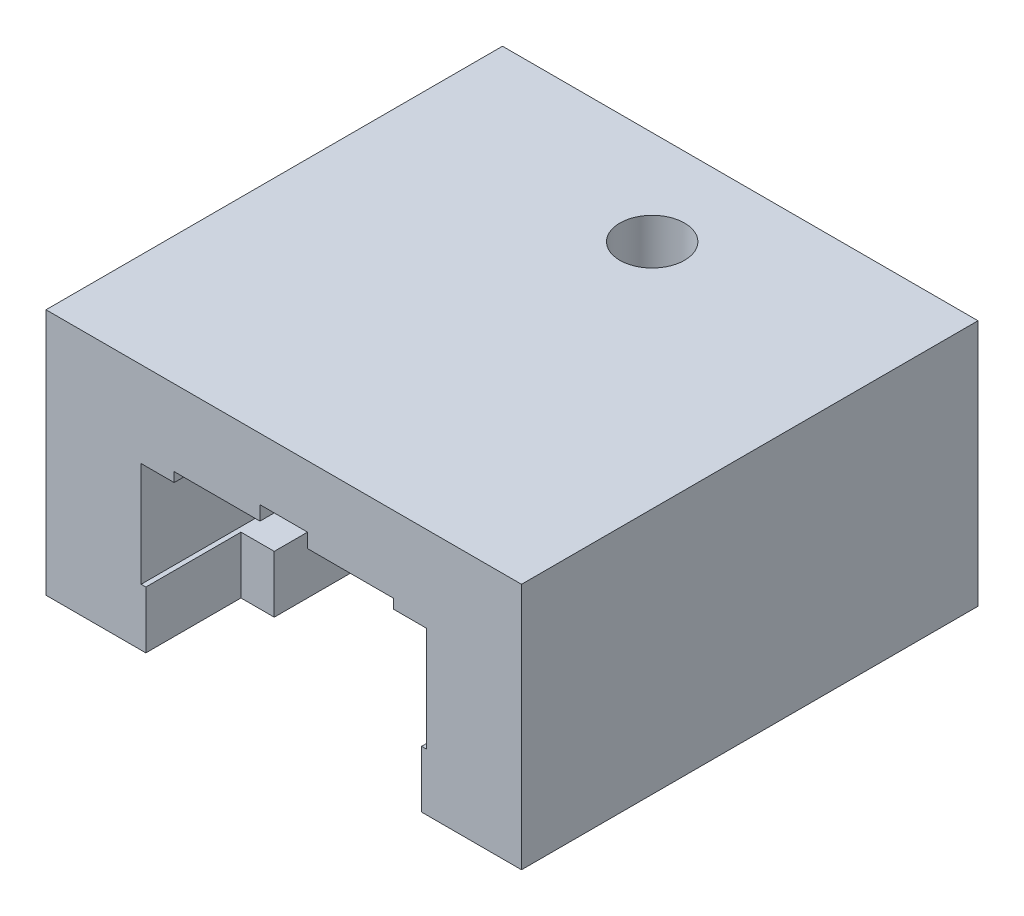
ISO-10303-21;
HEADER;
FILE_DESCRIPTION(('STEP AP214'),'2;1');
FILE_NAME('part.step','',(''),(''),'','','');
FILE_SCHEMA(('AUTOMOTIVE_DESIGN { 1 0 10303 214 1 1 1 1 }'));
ENDSEC;
DATA;
#1=APPLICATION_CONTEXT('core data for automotive mechanical design processes');
#2=APPLICATION_PROTOCOL_DEFINITION('international standard','automotive_design',2000,#1);
#3=PRODUCT_CONTEXT('',#1,'mechanical');
#4=PRODUCT('Part','Part','',(#3));
#5=PRODUCT_RELATED_PRODUCT_CATEGORY('part','',(#4));
#6=PRODUCT_DEFINITION_FORMATION('','',#4);
#7=PRODUCT_DEFINITION_CONTEXT('part definition',#1,'design');
#8=PRODUCT_DEFINITION('design','',#6,#7);
#9=PRODUCT_DEFINITION_SHAPE('','',#8);
#10=(LENGTH_UNIT() NAMED_UNIT(*) SI_UNIT(.MILLI.,.METRE.));
#11=(NAMED_UNIT(*) PLANE_ANGLE_UNIT() SI_UNIT($,.RADIAN.));
#12=(NAMED_UNIT(*) SI_UNIT($,.STERADIAN.) SOLID_ANGLE_UNIT());
#13=UNCERTAINTY_MEASURE_WITH_UNIT(LENGTH_MEASURE(1.E-05),#10,'distance_accuracy_value','');
#14=(GEOMETRIC_REPRESENTATION_CONTEXT(3) GLOBAL_UNCERTAINTY_ASSIGNED_CONTEXT((#13)) GLOBAL_UNIT_ASSIGNED_CONTEXT((#10,
#11,#12)) REPRESENTATION_CONTEXT('',''));
#15=CARTESIAN_POINT('',(0.,0.,0.));
#16=DIRECTION('',(0.,0.,1.));
#17=DIRECTION('',(1.,0.,0.));
#18=AXIS2_PLACEMENT_3D('',#15,#16,#17);
#19=CARTESIAN_POINT('',(16.,-8.,8.));
#20=DIRECTION('',(0.,0.,1.));
#21=DIRECTION('',(1.,0.,0.));
#22=AXIS2_PLACEMENT_3D('',#19,#20,#21);
#23=PLANE('',#22);
#24=DIRECTION('',(1.,0.,0.));
#25=VECTOR('',#24,1.);
#26=CARTESIAN_POINT('',(-15.,-9.,8.));
#27=LINE('',#26,#25);
#28=CARTESIAN_POINT('',(3.47100100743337,-9.,8.));
#29=VERTEX_POINT('',#28);
#30=CARTESIAN_POINT('',(15.,-9.,8.));
#31=VERTEX_POINT('',#30);
#32=EDGE_CURVE('E295',#29,#31,#27,.T.);
#33=ORIENTED_EDGE('',*,*,#32,.F.);
#34=DIRECTION('',(0.,1.,0.));
#35=VECTOR('',#34,1.);
#36=CARTESIAN_POINT('',(3.47100100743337,0.,8.));
#37=LINE('',#36,#35);
#38=CARTESIAN_POINT('',(3.47100100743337,-8.,8.));
#39=VERTEX_POINT('',#38);
#40=EDGE_CURVE('E46',#29,#39,#37,.T.);
#41=ORIENTED_EDGE('',*,*,#40,.T.);
#42=DIRECTION('',(-1.,0.,0.));
#43=VECTOR('',#42,1.);
#44=CARTESIAN_POINT('',(16.,-8.,8.));
#45=LINE('',#44,#43);
#46=CARTESIAN_POINT('',(13.,-8.,8.));
#47=VERTEX_POINT('',#46);
#48=EDGE_CURVE('E507',#47,#39,#45,.T.);
#49=ORIENTED_EDGE('',*,*,#48,.F.);
#50=CARTESIAN_POINT('',(13.,-11.,8.));
#51=DIRECTION('',(0.,0.,1.));
#52=DIRECTION('',(1.,0.,0.));
#53=AXIS2_PLACEMENT_3D('',#50,#51,#52);
#54=CIRCLE('',#53,3.);
#55=CARTESIAN_POINT('',(16.,-11.,8.));
#56=VERTEX_POINT('',#55);
#57=EDGE_CURVE('E486',#47,#56,#54,.F.);
#58=ORIENTED_EDGE('',*,*,#57,.T.);
#59=DIRECTION('',(0.,-1.,0.));
#60=VECTOR('',#59,1.);
#61=CARTESIAN_POINT('',(16.,-8.,8.));
#62=LINE('',#61,#60);
#63=CARTESIAN_POINT('',(16.,-26.,8.));
#64=VERTEX_POINT('',#63);
#65=EDGE_CURVE('E505',#56,#64,#62,.T.);
#66=ORIENTED_EDGE('',*,*,#65,.T.);
#67=DIRECTION('',(-1.,0.,0.));
#68=VECTOR('',#67,1.);
#69=CARTESIAN_POINT('',(16.,-26.,8.));
#70=LINE('',#69,#68);
#71=CARTESIAN_POINT('',(11.,-26.,8.));
#72=VERTEX_POINT('',#71);
#73=EDGE_CURVE('E547',#64,#72,#70,.T.);
#74=ORIENTED_EDGE('',*,*,#73,.T.);
#75=DIRECTION('',(0.,-1.,0.));
#76=VECTOR('',#75,1.);
#77=CARTESIAN_POINT('',(11.,-26.,8.));
#78=LINE('',#77,#76);
#79=CARTESIAN_POINT('',(11.,-19.9999999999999,8.));
#80=VERTEX_POINT('',#79);
#81=EDGE_CURVE('E514',#80,#72,#78,.T.);
#82=ORIENTED_EDGE('',*,*,#81,.F.);
#83=DIRECTION('',(-1.,0.,0.));
#84=VECTOR('',#83,1.);
#85=CARTESIAN_POINT('',(11.,-19.9999999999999,8.));
#86=LINE('',#85,#84);
#87=CARTESIAN_POINT('',(15.,-19.9999999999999,8.));
#88=VERTEX_POINT('',#87);
#89=EDGE_CURVE('E520',#88,#80,#86,.T.);
#90=ORIENTED_EDGE('',*,*,#89,.F.);
#91=DIRECTION('',(0.,-1.,0.));
#92=VECTOR('',#91,1.);
#93=CARTESIAN_POINT('',(15.,-19.9999999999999,8.));
#94=LINE('',#93,#92);
#95=EDGE_CURVE('E299',#31,#88,#94,.T.);
#96=ORIENTED_EDGE('',*,*,#95,.F.);
#97=EDGE_LOOP('',(#33,#41,#49,#58,#66,#74,#82,#90,#96));
#98=FACE_BOUND('',#97,.T.);
#99=ADVANCED_FACE('F31',(#98),#23,.F.);
#100=CARTESIAN_POINT('',(-11.,-26.,48.));
#101=DIRECTION('',(-1.,0.,0.));
#102=DIRECTION('',(0.,0.,1.));
#103=AXIS2_PLACEMENT_3D('',#100,#101,#102);
#104=PLANE('',#103);
#105=DIRECTION('',(0.,0.,-1.));
#106=VECTOR('',#105,1.);
#107=CARTESIAN_POINT('',(-11.,-26.,48.));
#108=LINE('',#107,#106);
#109=CARTESIAN_POINT('',(-11.,-26.,19.));
#110=VERTEX_POINT('',#109);
#111=CARTESIAN_POINT('',(-11.,-26.,8.));
#112=VERTEX_POINT('',#111);
#113=EDGE_CURVE('E446',#110,#112,#108,.T.);
#114=ORIENTED_EDGE('',*,*,#113,.T.);
#115=DIRECTION('',(0.,1.,0.));
#116=VECTOR('',#115,1.);
#117=CARTESIAN_POINT('',(-11.,-26.,8.));
#118=LINE('',#117,#116);
#119=CARTESIAN_POINT('',(-11.,-19.9999999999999,8.));
#120=VERTEX_POINT('',#119);
#121=EDGE_CURVE('E305',#112,#120,#118,.T.);
#122=ORIENTED_EDGE('',*,*,#121,.T.);
#123=DIRECTION('',(0.,0.,-1.));
#124=VECTOR('',#123,1.);
#125=CARTESIAN_POINT('',(-11.,-19.9999999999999,48.));
#126=LINE('',#125,#124);
#127=CARTESIAN_POINT('',(-11.,-20.,19.));
#128=VERTEX_POINT('',#127);
#129=EDGE_CURVE('E442',#128,#120,#126,.T.);
#130=ORIENTED_EDGE('',*,*,#129,.F.);
#131=DIRECTION('',(0.,-1.,0.));
#132=VECTOR('',#131,1.);
#133=CARTESIAN_POINT('',(-11.,-20.,19.));
#134=LINE('',#133,#132);
#135=EDGE_CURVE('E360',#128,#110,#134,.T.);
#136=ORIENTED_EDGE('',*,*,#135,.T.);
#137=EDGE_LOOP('',(#114,#122,#130,#136));
#138=FACE_BOUND('',#137,.T.);
#139=ADVANCED_FACE('F628',(#138),#104,.F.);
#140=CARTESIAN_POINT('',(-11.,-19.9999999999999,48.));
#141=DIRECTION('',(0.,-1.,0.));
#142=DIRECTION('',(0.,0.,-1.));
#143=AXIS2_PLACEMENT_3D('',#140,#141,#142);
#144=PLANE('',#143);
#145=DIRECTION('',(0.,0.,-1.));
#146=VECTOR('',#145,1.);
#147=CARTESIAN_POINT('',(-14.5,-19.9999999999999,48.));
#148=LINE('',#147,#146);
#149=CARTESIAN_POINT('',(-14.5,-19.9999999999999,48.));
#150=VERTEX_POINT('',#149);
#151=CARTESIAN_POINT('',(-14.5,-19.9999999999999,38.));
#152=VERTEX_POINT('',#151);
#153=EDGE_CURVE('E590',#150,#152,#148,.T.);
#154=ORIENTED_EDGE('',*,*,#153,.T.);
#155=DIRECTION('',(1.,0.,0.));
#156=VECTOR('',#155,1.);
#157=CARTESIAN_POINT('',(-11.,-19.9999999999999,38.));
#158=LINE('',#157,#156);
#159=CARTESIAN_POINT('',(-11.,-19.9999999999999,38.));
#160=VERTEX_POINT('',#159);
#161=EDGE_CURVE('E600',#152,#160,#158,.T.);
#162=ORIENTED_EDGE('',*,*,#161,.T.);
#163=CARTESIAN_POINT('',(-11.,-20.,29.));
#164=VERTEX_POINT('',#163);
#165=EDGE_CURVE('E444',#160,#164,#126,.T.);
#166=ORIENTED_EDGE('',*,*,#165,.T.);
#167=CARTESIAN_POINT('',(-11.,-20.,24.));
#168=DIRECTION('',(0.,-1.,0.));
#169=DIRECTION('',(0.,0.,-1.));
#170=AXIS2_PLACEMENT_3D('',#167,#168,#169);
#171=CIRCLE('',#170,5.);
#172=CARTESIAN_POINT('',(-15.,-20.,27.));
#173=VERTEX_POINT('',#172);
#174=EDGE_CURVE('E355',#164,#173,#171,.T.);
#175=ORIENTED_EDGE('',*,*,#174,.T.);
#176=DIRECTION('',(0.,0.,-1.));
#177=VECTOR('',#176,1.);
#178=CARTESIAN_POINT('',(-15.,-19.9999999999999,48.));
#179=LINE('',#178,#177);
#180=CARTESIAN_POINT('',(-15.,-19.9999999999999,48.));
#181=VERTEX_POINT('',#180);
#182=EDGE_CURVE('E439',#181,#173,#179,.T.);
#183=ORIENTED_EDGE('',*,*,#182,.F.);
#184=DIRECTION('',(-1.,0.,0.));
#185=VECTOR('',#184,1.);
#186=CARTESIAN_POINT('',(-11.,-19.9999999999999,48.));
#187=LINE('',#186,#185);
#188=EDGE_CURVE('E387',#150,#181,#187,.T.);
#189=ORIENTED_EDGE('',*,*,#188,.F.);
#190=EDGE_LOOP('',(#154,#162,#166,#175,#183,#189));
#191=FACE_BOUND('',#190,.T.);
#192=ADVANCED_FACE('F650',(#191),#144,.F.);
#193=CARTESIAN_POINT('',(11.,-19.9999999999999,48.));
#194=DIRECTION('',(0.,-1.,0.));
#195=DIRECTION('',(0.,0.,-1.));
#196=AXIS2_PLACEMENT_3D('',#193,#194,#195);
#197=PLANE('',#196);
#198=DIRECTION('',(0.,0.,-1.));
#199=VECTOR('',#198,1.);
#200=CARTESIAN_POINT('',(15.,-19.9999999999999,48.));
#201=LINE('',#200,#199);
#202=CARTESIAN_POINT('',(15.,-20.,21.));
#203=VERTEX_POINT('',#202);
#204=EDGE_CURVE('E430',#203,#88,#201,.T.);
#205=ORIENTED_EDGE('',*,*,#204,.T.);
#206=ORIENTED_EDGE('',*,*,#89,.T.);
#207=DIRECTION('',(0.,0.,-1.));
#208=VECTOR('',#207,1.);
#209=CARTESIAN_POINT('',(11.,-19.9999999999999,48.));
#210=LINE('',#209,#208);
#211=CARTESIAN_POINT('',(11.,-20.,19.));
#212=VERTEX_POINT('',#211);
#213=EDGE_CURVE('E427',#212,#80,#210,.T.);
#214=ORIENTED_EDGE('',*,*,#213,.F.);
#215=CARTESIAN_POINT('',(11.,-20.,24.));
#216=DIRECTION('',(0.,-1.,0.));
#217=DIRECTION('',(0.,0.,-1.));
#218=AXIS2_PLACEMENT_3D('',#215,#216,#217);
#219=CIRCLE('',#218,5.);
#220=EDGE_CURVE('E364',#212,#203,#219,.T.);
#221=ORIENTED_EDGE('',*,*,#220,.T.);
#222=EDGE_LOOP('',(#205,#206,#214,#221));
#223=FACE_BOUND('',#222,.T.);
#224=ADVANCED_FACE('F534',(#223),#197,.F.);
#225=CARTESIAN_POINT('',(11.,-26.,48.));
#226=DIRECTION('',(1.,0.,0.));
#227=DIRECTION('',(0.,0.,-1.));
#228=AXIS2_PLACEMENT_3D('',#225,#226,#227);
#229=PLANE('',#228);
#230=DIRECTION('',(0.,0.,-1.));
#231=VECTOR('',#230,1.);
#232=CARTESIAN_POINT('',(11.,-26.,48.));
#233=LINE('',#232,#231);
#234=CARTESIAN_POINT('',(11.,-26.,38.));
#235=VERTEX_POINT('',#234);
#236=CARTESIAN_POINT('',(11.,-26.,29.));
#237=VERTEX_POINT('',#236);
#238=EDGE_CURVE('E425',#235,#237,#233,.T.);
#239=ORIENTED_EDGE('',*,*,#238,.F.);
#240=DIRECTION('',(0.,1.,0.));
#241=VECTOR('',#240,1.);
#242=CARTESIAN_POINT('',(11.,-26.,38.));
#243=LINE('',#242,#241);
#244=CARTESIAN_POINT('',(11.,-19.9999999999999,38.));
#245=VERTEX_POINT('',#244);
#246=EDGE_CURVE('E556',#235,#245,#243,.T.);
#247=ORIENTED_EDGE('',*,*,#246,.T.);
#248=CARTESIAN_POINT('',(11.,-20.,29.));
#249=VERTEX_POINT('',#248);
#250=EDGE_CURVE('E428',#245,#249,#210,.T.);
#251=ORIENTED_EDGE('',*,*,#250,.T.);
#252=DIRECTION('',(0.,-1.,0.));
#253=VECTOR('',#252,1.);
#254=CARTESIAN_POINT('',(11.,-20.,29.));
#255=LINE('',#254,#253);
#256=EDGE_CURVE('E374',#249,#237,#255,.T.);
#257=ORIENTED_EDGE('',*,*,#256,.T.);
#258=EDGE_LOOP('',(#239,#247,#251,#257));
#259=FACE_BOUND('',#258,.T.);
#260=ADVANCED_FACE('F553',(#259),#229,.F.);
#261=CARTESIAN_POINT('',(-25.,0.,48.));
#262=DIRECTION('',(1.,0.,0.));
#263=DIRECTION('',(0.,1.,0.));
#264=AXIS2_PLACEMENT_3D('',#261,#262,#263);
#265=PLANE('',#264);
#266=DIRECTION('',(0.,-1.,0.));
#267=VECTOR('',#266,1.);
#268=CARTESIAN_POINT('',(-25.,0.,0.));
#269=LINE('',#268,#267);
#270=CARTESIAN_POINT('',(-25.,0.,0.));
#271=VERTEX_POINT('',#270);
#272=CARTESIAN_POINT('',(-25.,-26.,0.));
#273=VERTEX_POINT('',#272);
#274=EDGE_CURVE('E379',#271,#273,#269,.T.);
#275=ORIENTED_EDGE('',*,*,#274,.T.);
#276=DIRECTION('',(0.,0.,-1.));
#277=VECTOR('',#276,1.);
#278=CARTESIAN_POINT('',(-25.,-26.,48.));
#279=LINE('',#278,#277);
#280=CARTESIAN_POINT('',(-25.,-26.,48.));
#281=VERTEX_POINT('',#280);
#282=EDGE_CURVE('E449',#281,#273,#279,.T.);
#283=ORIENTED_EDGE('',*,*,#282,.F.);
#284=DIRECTION('',(0.,-1.,0.));
#285=VECTOR('',#284,1.);
#286=CARTESIAN_POINT('',(-25.,0.,48.));
#287=LINE('',#286,#285);
#288=CARTESIAN_POINT('',(-25.,0.,48.));
#289=VERTEX_POINT('',#288);
#290=EDGE_CURVE('E380',#289,#281,#287,.T.);
#291=ORIENTED_EDGE('',*,*,#290,.F.);
#292=DIRECTION('',(0.,0.,-1.));
#293=VECTOR('',#292,1.);
#294=CARTESIAN_POINT('',(-25.,0.,48.));
#295=LINE('',#294,#293);
#296=EDGE_CURVE('E405',#289,#271,#295,.T.);
#297=ORIENTED_EDGE('',*,*,#296,.T.);
#298=EDGE_LOOP('',(#275,#283,#291,#297));
#299=FACE_BOUND('',#298,.T.);
#300=ADVANCED_FACE('F667',(#299),#265,.F.);
#301=CARTESIAN_POINT('',(-25.,-26.,48.));
#302=DIRECTION('',(0.,1.,0.));
#303=DIRECTION('',(0.,0.,1.));
#304=AXIS2_PLACEMENT_3D('',#301,#302,#303);
#305=PLANE('',#304);
#306=CARTESIAN_POINT('',(-11.,-26.,38.));
#307=VERTEX_POINT('',#306);
#308=CARTESIAN_POINT('',(-11.,-26.,29.));
#309=VERTEX_POINT('',#308);
#310=EDGE_CURVE('E447',#307,#309,#108,.T.);
#311=ORIENTED_EDGE('',*,*,#310,.F.);
#312=DIRECTION('',(1.,0.,0.));
#313=VECTOR('',#312,1.);
#314=CARTESIAN_POINT('',(14.5,-26.,38.));
#315=LINE('',#314,#313);
#316=CARTESIAN_POINT('',(-14.5,-26.,38.));
#317=VERTEX_POINT('',#316);
#318=EDGE_CURVE('E585',#317,#307,#315,.T.);
#319=ORIENTED_EDGE('',*,*,#318,.F.);
#320=DIRECTION('',(0.,0.,-1.));
#321=VECTOR('',#320,1.);
#322=CARTESIAN_POINT('',(-14.5,-26.,38.));
#323=LINE('',#322,#321);
#324=CARTESIAN_POINT('',(-14.5,-26.,48.));
#325=VERTEX_POINT('',#324);
#326=EDGE_CURVE('E581',#325,#317,#323,.T.);
#327=ORIENTED_EDGE('',*,*,#326,.F.);
#328=DIRECTION('',(1.,0.,0.));
#329=VECTOR('',#328,1.);
#330=CARTESIAN_POINT('',(-25.,-26.,48.));
#331=LINE('',#330,#329);
#332=EDGE_CURVE('E383',#281,#325,#331,.T.);
#333=ORIENTED_EDGE('',*,*,#332,.F.);
#334=ORIENTED_EDGE('',*,*,#282,.T.);
#335=DIRECTION('',(1.,0.,0.));
#336=VECTOR('',#335,1.);
#337=CARTESIAN_POINT('',(-25.,-26.,0.));
#338=LINE('',#337,#336);
#339=CARTESIAN_POINT('',(-16.,-26.,0.));
#340=VERTEX_POINT('',#339);
#341=EDGE_CURVE('E408',#273,#340,#338,.T.);
#342=ORIENTED_EDGE('',*,*,#341,.T.);
#343=DIRECTION('',(0.,0.,-1.));
#344=VECTOR('',#343,1.);
#345=CARTESIAN_POINT('',(-16.,-26.,8.));
#346=LINE('',#345,#344);
#347=CARTESIAN_POINT('',(-16.,-26.,8.));
#348=VERTEX_POINT('',#347);
#349=EDGE_CURVE('E605',#348,#340,#346,.T.);
#350=ORIENTED_EDGE('',*,*,#349,.F.);
#351=EDGE_CURVE('E604',#112,#348,#70,.T.);
#352=ORIENTED_EDGE('',*,*,#351,.F.);
#353=ORIENTED_EDGE('',*,*,#113,.F.);
#354=CARTESIAN_POINT('',(-11.,-26.,24.));
#355=DIRECTION('',(0.,-1.,0.));
#356=DIRECTION('',(0.,0.,-1.));
#357=AXIS2_PLACEMENT_3D('',#354,#355,#356);
#358=CIRCLE('',#357,5.);
#359=EDGE_CURVE('E348',#309,#110,#358,.T.);
#360=ORIENTED_EDGE('',*,*,#359,.F.);
#361=EDGE_LOOP('',(#311,#319,#327,#333,#334,#342,#350,#352,#353,#360));
#362=FACE_BOUND('',#361,.T.);
#363=ADVANCED_FACE('F617',(#362),#305,.F.);
#364=ORIENTED_EDGE('',*,*,#165,.F.);
#365=DIRECTION('',(0.,-1.,0.));
#366=VECTOR('',#365,1.);
#367=CARTESIAN_POINT('',(-11.,-26.,38.));
#368=LINE('',#367,#366);
#369=EDGE_CURVE('E597',#160,#307,#368,.T.);
#370=ORIENTED_EDGE('',*,*,#369,.T.);
#371=ORIENTED_EDGE('',*,*,#310,.T.);
#372=DIRECTION('',(0.,-1.,0.));
#373=VECTOR('',#372,1.);
#374=CARTESIAN_POINT('',(-11.,-20.,29.));
#375=LINE('',#374,#373);
#376=EDGE_CURVE('E357',#309,#164,#375,.F.);
#377=ORIENTED_EDGE('',*,*,#376,.T.);
#378=EDGE_LOOP('',(#364,#370,#371,#377));
#379=FACE_BOUND('',#378,.T.);
#380=ADVANCED_FACE('F654',(#379),#104,.F.);
#381=ORIENTED_EDGE('',*,*,#129,.T.);
#382=DIRECTION('',(-1.,0.,0.));
#383=VECTOR('',#382,1.);
#384=CARTESIAN_POINT('',(-11.,-19.9999999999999,8.));
#385=LINE('',#384,#383);
#386=CARTESIAN_POINT('',(-15.,-19.9999999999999,8.));
#387=VERTEX_POINT('',#386);
#388=EDGE_CURVE('E297',#120,#387,#385,.T.);
#389=ORIENTED_EDGE('',*,*,#388,.T.);
#390=CARTESIAN_POINT('',(-15.,-19.9999999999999,21.));
#391=VERTEX_POINT('',#390);
#392=EDGE_CURVE('E438',#391,#387,#179,.T.);
#393=ORIENTED_EDGE('',*,*,#392,.F.);
#394=EDGE_CURVE('E351',#391,#128,#171,.T.);
#395=ORIENTED_EDGE('',*,*,#394,.T.);
#396=EDGE_LOOP('',(#381,#389,#393,#395));
#397=FACE_BOUND('',#396,.T.);
#398=ADVANCED_FACE('F638',(#397),#144,.F.);
#399=CARTESIAN_POINT('',(-15.,-19.9999999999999,48.));
#400=DIRECTION('',(-1.,0.,0.));
#401=DIRECTION('',(0.,-1.,0.));
#402=AXIS2_PLACEMENT_3D('',#399,#400,#401);
#403=PLANE('',#402);
#404=ORIENTED_EDGE('',*,*,#392,.T.);
#405=DIRECTION('',(0.,1.,0.));
#406=VECTOR('',#405,1.);
#407=CARTESIAN_POINT('',(-15.,-19.9999999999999,8.));
#408=LINE('',#407,#406);
#409=CARTESIAN_POINT('',(-15.,-9.,8.));
#410=VERTEX_POINT('',#409);
#411=EDGE_CURVE('E294',#387,#410,#408,.T.);
#412=ORIENTED_EDGE('',*,*,#411,.T.);
#413=DIRECTION('',(0.,0.,-1.));
#414=VECTOR('',#413,1.);
#415=CARTESIAN_POINT('',(-15.,-9.,48.));
#416=LINE('',#415,#414);
#417=CARTESIAN_POINT('',(-15.,-9.,48.));
#418=VERTEX_POINT('',#417);
#419=EDGE_CURVE('E293',#418,#410,#416,.T.);
#420=ORIENTED_EDGE('',*,*,#419,.F.);
#421=DIRECTION('',(0.,1.,0.));
#422=VECTOR('',#421,1.);
#423=CARTESIAN_POINT('',(-15.,-19.9999999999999,48.));
#424=LINE('',#423,#422);
#425=EDGE_CURVE('E389',#181,#418,#424,.T.);
#426=ORIENTED_EDGE('',*,*,#425,.F.);
#427=ORIENTED_EDGE('',*,*,#182,.T.);
#428=EDGE_CURVE('E443',#173,#391,#179,.T.);
#429=ORIENTED_EDGE('',*,*,#428,.T.);
#430=EDGE_LOOP('',(#404,#412,#420,#426,#427,#429));
#431=FACE_BOUND('',#430,.T.);
#432=ADVANCED_FACE('F642',(#431),#403,.F.);
#433=CARTESIAN_POINT('',(-15.,-9.,48.));
#434=DIRECTION('',(0.,1.,0.));
#435=DIRECTION('',(0.,0.,1.));
#436=AXIS2_PLACEMENT_3D('',#433,#434,#435);
#437=PLANE('',#436);
#438=CARTESIAN_POINT('',(-2.12830801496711,-9.,8.));
#439=VERTEX_POINT('',#438);
#440=EDGE_CURVE('E283',#410,#439,#27,.T.);
#441=ORIENTED_EDGE('',*,*,#440,.T.);
#442=CARTESIAN_POINT('',(0.671346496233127,-9.,9.92923161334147));
#443=DIRECTION('',(0.,1.,0.));
#444=DIRECTION('',(0.,0.,1.));
#445=AXIS2_PLACEMENT_3D('',#442,#443,#444);
#446=CIRCLE('',#445,3.4);
#447=EDGE_CURVE('E11',#439,#29,#446,.T.);
#448=ORIENTED_EDGE('',*,*,#447,.T.);
#449=ORIENTED_EDGE('',*,*,#32,.T.);
#450=DIRECTION('',(0.,0.,-1.));
#451=VECTOR('',#450,1.);
#452=CARTESIAN_POINT('',(15.,-9.,48.));
#453=LINE('',#452,#451);
#454=CARTESIAN_POINT('',(15.,-9.,48.));
#455=VERTEX_POINT('',#454);
#456=EDGE_CURVE('E434',#455,#31,#453,.T.);
#457=ORIENTED_EDGE('',*,*,#456,.F.);
#458=DIRECTION('',(1.,0.,0.));
#459=VECTOR('',#458,1.);
#460=CARTESIAN_POINT('',(-15.,-9.,48.));
#461=LINE('',#460,#459);
#462=CARTESIAN_POINT('',(11.5245440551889,-9.,48.));
#463=VERTEX_POINT('',#462);
#464=EDGE_CURVE('E391',#463,#455,#461,.T.);
#465=ORIENTED_EDGE('',*,*,#464,.F.);
#466=DIRECTION('',(0.,0.,1.));
#467=VECTOR('',#466,1.);
#468=CARTESIAN_POINT('',(11.5245440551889,-9.,25.));
#469=LINE('',#468,#467);
#470=CARTESIAN_POINT('',(11.5245440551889,-9.,25.));
#471=VERTEX_POINT('',#470);
#472=EDGE_CURVE('E334',#471,#463,#469,.T.);
#473=ORIENTED_EDGE('',*,*,#472,.F.);
#474=CARTESIAN_POINT('',(0.,-9.,25.));
#475=DIRECTION('',(0.,-1.,0.));
#476=DIRECTION('',(0.,0.,-1.));
#477=AXIS2_PLACEMENT_3D('',#474,#475,#476);
#478=CIRCLE('',#477,11.5245440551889);
#479=CARTESIAN_POINT('',(-11.5245440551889,-9.,25.));
#480=VERTEX_POINT('',#479);
#481=EDGE_CURVE('E342',#480,#471,#478,.T.);
#482=ORIENTED_EDGE('',*,*,#481,.F.);
#483=DIRECTION('',(0.,0.,-1.));
#484=VECTOR('',#483,1.);
#485=CARTESIAN_POINT('',(-11.5245440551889,-9.,25.));
#486=LINE('',#485,#484);
#487=CARTESIAN_POINT('',(-11.5245440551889,-9.,48.));
#488=VERTEX_POINT('',#487);
#489=EDGE_CURVE('E330',#488,#480,#486,.T.);
#490=ORIENTED_EDGE('',*,*,#489,.F.);
#491=EDGE_CURVE('E392',#418,#488,#461,.T.);
#492=ORIENTED_EDGE('',*,*,#491,.F.);
#493=ORIENTED_EDGE('',*,*,#419,.T.);
#494=EDGE_LOOP('',(#441,#448,#449,#457,#465,#473,#482,#490,#492,#493));
#495=FACE_BOUND('',#494,.T.);
#496=ADVANCED_FACE('F290',(#495),#437,.F.);
#497=CARTESIAN_POINT('',(15.,-19.9999999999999,48.));
#498=DIRECTION('',(1.,0.,0.));
#499=DIRECTION('',(0.,1.,0.));
#500=AXIS2_PLACEMENT_3D('',#497,#498,#499);
#501=PLANE('',#500);
#502=ORIENTED_EDGE('',*,*,#456,.T.);
#503=ORIENTED_EDGE('',*,*,#95,.T.);
#504=ORIENTED_EDGE('',*,*,#204,.F.);
#505=DIRECTION('',(0.,0.,-1.));
#506=VECTOR('',#505,1.);
#507=CARTESIAN_POINT('',(15.,-20.,48.));
#508=LINE('',#507,#506);
#509=CARTESIAN_POINT('',(15.,-20.,27.));
#510=VERTEX_POINT('',#509);
#511=EDGE_CURVE('E377',#510,#203,#508,.T.);
#512=ORIENTED_EDGE('',*,*,#511,.F.);
#513=CARTESIAN_POINT('',(15.,-19.9999999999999,48.));
#514=VERTEX_POINT('',#513);
#515=EDGE_CURVE('E431',#514,#510,#201,.T.);
#516=ORIENTED_EDGE('',*,*,#515,.F.);
#517=DIRECTION('',(0.,-1.,0.));
#518=VECTOR('',#517,1.);
#519=CARTESIAN_POINT('',(15.,-19.9999999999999,48.));
#520=LINE('',#519,#518);
#521=EDGE_CURVE('E394',#455,#514,#520,.T.);
#522=ORIENTED_EDGE('',*,*,#521,.F.);
#523=EDGE_LOOP('',(#502,#503,#504,#512,#516,#522));
#524=FACE_BOUND('',#523,.T.);
#525=ADVANCED_FACE('F530',(#524),#501,.F.);
#526=DIRECTION('',(1.,0.,0.));
#527=VECTOR('',#526,1.);
#528=CARTESIAN_POINT('',(11.,-19.9999999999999,38.));
#529=LINE('',#528,#527);
#530=CARTESIAN_POINT('',(14.5,-19.9999999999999,38.));
#531=VERTEX_POINT('',#530);
#532=EDGE_CURVE('E561',#245,#531,#529,.T.);
#533=ORIENTED_EDGE('',*,*,#532,.T.);
#534=DIRECTION('',(0.,0.,1.));
#535=VECTOR('',#534,1.);
#536=CARTESIAN_POINT('',(14.5,-19.9999999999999,48.));
#537=LINE('',#536,#535);
#538=CARTESIAN_POINT('',(14.5,-19.9999999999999,48.));
#539=VERTEX_POINT('',#538);
#540=EDGE_CURVE('E566',#531,#539,#537,.T.);
#541=ORIENTED_EDGE('',*,*,#540,.T.);
#542=DIRECTION('',(-1.,0.,0.));
#543=VECTOR('',#542,1.);
#544=CARTESIAN_POINT('',(11.,-19.9999999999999,48.));
#545=LINE('',#544,#543);
#546=EDGE_CURVE('E396',#514,#539,#545,.T.);
#547=ORIENTED_EDGE('',*,*,#546,.F.);
#548=ORIENTED_EDGE('',*,*,#515,.T.);
#549=EDGE_CURVE('E369',#510,#249,#219,.T.);
#550=ORIENTED_EDGE('',*,*,#549,.T.);
#551=ORIENTED_EDGE('',*,*,#250,.F.);
#552=EDGE_LOOP('',(#533,#541,#547,#548,#550,#551));
#553=FACE_BOUND('',#552,.T.);
#554=ADVANCED_FACE('F559',(#553),#197,.F.);
#555=ORIENTED_EDGE('',*,*,#213,.T.);
#556=ORIENTED_EDGE('',*,*,#81,.T.);
#557=CARTESIAN_POINT('',(11.,-26.,19.));
#558=VERTEX_POINT('',#557);
#559=EDGE_CURVE('E424',#558,#72,#233,.T.);
#560=ORIENTED_EDGE('',*,*,#559,.F.);
#561=DIRECTION('',(0.,-1.,0.));
#562=VECTOR('',#561,1.);
#563=CARTESIAN_POINT('',(11.,-20.,19.));
#564=LINE('',#563,#562);
#565=EDGE_CURVE('E367',#558,#212,#564,.F.);
#566=ORIENTED_EDGE('',*,*,#565,.T.);
#567=EDGE_LOOP('',(#555,#556,#560,#566));
#568=FACE_BOUND('',#567,.T.);
#569=ADVANCED_FACE('F542',(#568),#229,.F.);
#570=CARTESIAN_POINT('',(25.,-26.,48.));
#571=DIRECTION('',(0.,1.,0.));
#572=DIRECTION('',(0.,0.,1.));
#573=AXIS2_PLACEMENT_3D('',#570,#571,#572);
#574=PLANE('',#573);
#575=DIRECTION('',(1.,0.,0.));
#576=VECTOR('',#575,1.);
#577=CARTESIAN_POINT('',(25.,-26.,48.));
#578=LINE('',#577,#576);
#579=CARTESIAN_POINT('',(14.5,-26.,48.));
#580=VERTEX_POINT('',#579);
#581=CARTESIAN_POINT('',(25.,-26.,48.));
#582=VERTEX_POINT('',#581);
#583=EDGE_CURVE('E399',#580,#582,#578,.T.);
#584=ORIENTED_EDGE('',*,*,#583,.F.);
#585=DIRECTION('',(0.,0.,1.));
#586=VECTOR('',#585,1.);
#587=CARTESIAN_POINT('',(14.5,-26.,38.));
#588=LINE('',#587,#586);
#589=CARTESIAN_POINT('',(14.5,-26.,38.));
#590=VERTEX_POINT('',#589);
#591=EDGE_CURVE('E573',#590,#580,#588,.T.);
#592=ORIENTED_EDGE('',*,*,#591,.F.);
#593=EDGE_CURVE('E584',#235,#590,#315,.T.);
#594=ORIENTED_EDGE('',*,*,#593,.F.);
#595=ORIENTED_EDGE('',*,*,#238,.T.);
#596=CARTESIAN_POINT('',(11.,-26.,24.));
#597=DIRECTION('',(0.,-1.,0.));
#598=DIRECTION('',(0.,0.,-1.));
#599=AXIS2_PLACEMENT_3D('',#596,#597,#598);
#600=CIRCLE('',#599,5.);
#601=EDGE_CURVE('E363',#558,#237,#600,.T.);
#602=ORIENTED_EDGE('',*,*,#601,.F.);
#603=ORIENTED_EDGE('',*,*,#559,.T.);
#604=ORIENTED_EDGE('',*,*,#73,.F.);
#605=DIRECTION('',(0.,0.,1.));
#606=VECTOR('',#605,1.);
#607=CARTESIAN_POINT('',(16.,-26.,8.));
#608=LINE('',#607,#606);
#609=CARTESIAN_POINT('',(16.,-26.,0.));
#610=VERTEX_POINT('',#609);
#611=EDGE_CURVE('E510',#610,#64,#608,.T.);
#612=ORIENTED_EDGE('',*,*,#611,.F.);
#613=DIRECTION('',(1.,0.,0.));
#614=VECTOR('',#613,1.);
#615=CARTESIAN_POINT('',(25.,-26.,0.));
#616=LINE('',#615,#614);
#617=CARTESIAN_POINT('',(25.,-26.,0.));
#618=VERTEX_POINT('',#617);
#619=EDGE_CURVE('E411',#610,#618,#616,.T.);
#620=ORIENTED_EDGE('',*,*,#619,.T.);
#621=DIRECTION('',(0.,0.,-1.));
#622=VECTOR('',#621,1.);
#623=CARTESIAN_POINT('',(25.,-26.,48.));
#624=LINE('',#623,#622);
#625=EDGE_CURVE('E421',#582,#618,#624,.T.);
#626=ORIENTED_EDGE('',*,*,#625,.F.);
#627=EDGE_LOOP('',(#584,#592,#594,#595,#602,#603,#604,#612,#620,#626));
#628=FACE_BOUND('',#627,.T.);
#629=ADVANCED_FACE('F546',(#628),#574,.F.);
#630=CARTESIAN_POINT('',(25.,0.,48.));
#631=DIRECTION('',(-1.,0.,0.));
#632=DIRECTION('',(0.,-1.,0.));
#633=AXIS2_PLACEMENT_3D('',#630,#631,#632);
#634=PLANE('',#633);
#635=DIRECTION('',(0.,1.,0.));
#636=VECTOR('',#635,1.);
#637=CARTESIAN_POINT('',(25.,0.,0.));
#638=LINE('',#637,#636);
#639=CARTESIAN_POINT('',(25.,0.,0.));
#640=VERTEX_POINT('',#639);
#641=EDGE_CURVE('E413',#618,#640,#638,.T.);
#642=ORIENTED_EDGE('',*,*,#641,.T.);
#643=DIRECTION('',(0.,0.,-1.));
#644=VECTOR('',#643,1.);
#645=CARTESIAN_POINT('',(25.,0.,48.));
#646=LINE('',#645,#644);
#647=CARTESIAN_POINT('',(25.,0.,48.));
#648=VERTEX_POINT('',#647);
#649=EDGE_CURVE('E418',#648,#640,#646,.T.);
#650=ORIENTED_EDGE('',*,*,#649,.F.);
#651=DIRECTION('',(0.,1.,0.));
#652=VECTOR('',#651,1.);
#653=CARTESIAN_POINT('',(25.,0.,48.));
#654=LINE('',#653,#652);
#655=EDGE_CURVE('E401',#582,#648,#654,.T.);
#656=ORIENTED_EDGE('',*,*,#655,.F.);
#657=ORIENTED_EDGE('',*,*,#625,.T.);
#658=EDGE_LOOP('',(#642,#650,#656,#657));
#659=FACE_BOUND('',#658,.T.);
#660=ADVANCED_FACE('F673',(#659),#634,.F.);
#661=CARTESIAN_POINT('',(-25.,0.,48.));
#662=DIRECTION('',(0.,-1.,0.));
#663=DIRECTION('',(0.,0.,-1.));
#664=AXIS2_PLACEMENT_3D('',#661,#662,#663);
#665=PLANE('',#664);
#666=CARTESIAN_POINT('',(0.671346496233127,0.,9.92923161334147));
#667=DIRECTION('',(0.,1.,0.));
#668=DIRECTION('',(0.,0.,1.));
#669=AXIS2_PLACEMENT_3D('',#666,#667,#668);
#670=CIRCLE('',#669,3.4);
#671=CARTESIAN_POINT('',(0.671346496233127,0.,13.3292316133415));
#672=VERTEX_POINT('',#671);
#673=EDGE_CURVE('E575',#672,#672,#670,.T.);
#674=ORIENTED_EDGE('',*,*,#673,.F.);
#675=EDGE_LOOP('',(#674));
#676=FACE_BOUND('',#675,.T.);
#677=DIRECTION('',(-1.,0.,0.));
#678=VECTOR('',#677,1.);
#679=CARTESIAN_POINT('',(-25.,0.,0.));
#680=LINE('',#679,#678);
#681=EDGE_CURVE('E384',#640,#271,#680,.T.);
#682=ORIENTED_EDGE('',*,*,#681,.T.);
#683=ORIENTED_EDGE('',*,*,#296,.F.);
#684=DIRECTION('',(-1.,0.,0.));
#685=VECTOR('',#684,1.);
#686=CARTESIAN_POINT('',(-25.,0.,48.));
#687=LINE('',#686,#685);
#688=EDGE_CURVE('E403',#648,#289,#687,.T.);
#689=ORIENTED_EDGE('',*,*,#688,.F.);
#690=ORIENTED_EDGE('',*,*,#649,.T.);
#691=EDGE_LOOP('',(#682,#683,#689,#690));
#692=FACE_BOUND('',#691,.T.);
#693=ADVANCED_FACE('F669',(#676,#692),#665,.F.);
#694=CARTESIAN_POINT('',(-25.,-9.,48.));
#695=DIRECTION('',(0.,0.,1.));
#696=DIRECTION('',(1.,0.,0.));
#697=AXIS2_PLACEMENT_3D('',#694,#695,#696);
#698=PLANE('',#697);
#699=DIRECTION('',(0.,1.,0.));
#700=VECTOR('',#699,1.);
#701=CARTESIAN_POINT('',(14.5,-9.,48.));
#702=LINE('',#701,#700);
#703=EDGE_CURVE('E476',#580,#539,#702,.T.);
#704=ORIENTED_EDGE('',*,*,#703,.F.);
#705=ORIENTED_EDGE('',*,*,#583,.T.);
#706=ORIENTED_EDGE('',*,*,#655,.T.);
#707=ORIENTED_EDGE('',*,*,#688,.T.);
#708=ORIENTED_EDGE('',*,*,#290,.T.);
#709=ORIENTED_EDGE('',*,*,#332,.T.);
#710=DIRECTION('',(0.,-1.,0.));
#711=VECTOR('',#710,1.);
#712=CARTESIAN_POINT('',(-14.5,-9.,48.));
#713=LINE('',#712,#711);
#714=EDGE_CURVE('E474',#150,#325,#713,.T.);
#715=ORIENTED_EDGE('',*,*,#714,.F.);
#716=ORIENTED_EDGE('',*,*,#188,.T.);
#717=ORIENTED_EDGE('',*,*,#425,.T.);
#718=ORIENTED_EDGE('',*,*,#491,.T.);
#719=DIRECTION('',(0.,-1.,0.));
#720=VECTOR('',#719,1.);
#721=CARTESIAN_POINT('',(-11.5245440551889,-9.,48.));
#722=LINE('',#721,#720);
#723=CARTESIAN_POINT('',(-11.5245440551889,-8.,48.));
#724=VERTEX_POINT('',#723);
#725=EDGE_CURVE('E456',#724,#488,#722,.T.);
#726=ORIENTED_EDGE('',*,*,#725,.F.);
#727=DIRECTION('',(1.,0.,0.));
#728=VECTOR('',#727,1.);
#729=CARTESIAN_POINT('',(-25.,-8.,48.));
#730=LINE('',#729,#728);
#731=CARTESIAN_POINT('',(-2.5,-8.,48.));
#732=VERTEX_POINT('',#731);
#733=EDGE_CURVE('E453',#724,#732,#730,.T.);
#734=ORIENTED_EDGE('',*,*,#733,.T.);
#735=DIRECTION('',(0.,-1.,0.));
#736=VECTOR('',#735,1.);
#737=CARTESIAN_POINT('',(-2.5,-9.,48.));
#738=LINE('',#737,#736);
#739=CARTESIAN_POINT('',(-2.5,-6.5,48.));
#740=VERTEX_POINT('',#739);
#741=EDGE_CURVE('E324',#740,#732,#738,.T.);
#742=ORIENTED_EDGE('',*,*,#741,.F.);
#743=DIRECTION('',(1.,0.,0.));
#744=VECTOR('',#743,1.);
#745=CARTESIAN_POINT('',(-25.,-6.5,48.));
#746=LINE('',#745,#744);
#747=CARTESIAN_POINT('',(2.5,-6.5,48.));
#748=VERTEX_POINT('',#747);
#749=EDGE_CURVE('E464',#740,#748,#746,.T.);
#750=ORIENTED_EDGE('',*,*,#749,.T.);
#751=DIRECTION('',(0.,1.,0.));
#752=VECTOR('',#751,1.);
#753=CARTESIAN_POINT('',(2.5,-9.,48.));
#754=LINE('',#753,#752);
#755=CARTESIAN_POINT('',(2.5,-8.,48.));
#756=VERTEX_POINT('',#755);
#757=EDGE_CURVE('E328',#756,#748,#754,.T.);
#758=ORIENTED_EDGE('',*,*,#757,.F.);
#759=CARTESIAN_POINT('',(11.5245440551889,-8.,48.));
#760=VERTEX_POINT('',#759);
#761=EDGE_CURVE('E452',#756,#760,#730,.T.);
#762=ORIENTED_EDGE('',*,*,#761,.T.);
#763=DIRECTION('',(0.,1.,0.));
#764=VECTOR('',#763,1.);
#765=CARTESIAN_POINT('',(11.5245440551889,-9.,48.));
#766=LINE('',#765,#764);
#767=EDGE_CURVE('E459',#463,#760,#766,.T.);
#768=ORIENTED_EDGE('',*,*,#767,.F.);
#769=ORIENTED_EDGE('',*,*,#464,.T.);
#770=ORIENTED_EDGE('',*,*,#521,.T.);
#771=ORIENTED_EDGE('',*,*,#546,.T.);
#772=EDGE_LOOP('',(#704,#705,#706,#707,#708,#709,#715,#716,#717,#718,#726,#734,#742,#750,#758,
#762,#768,#769,#770,#771));
#773=FACE_BOUND('',#772,.T.);
#774=ADVANCED_FACE('F569',(#773),#698,.T.);
#775=CARTESIAN_POINT('',(-25.,-9.,0.));
#776=DIRECTION('',(0.,0.,1.));
#777=DIRECTION('',(1.,0.,0.));
#778=AXIS2_PLACEMENT_3D('',#775,#776,#777);
#779=PLANE('',#778);
#780=ORIENTED_EDGE('',*,*,#619,.F.);
#781=DIRECTION('',(0.,1.,0.));
#782=VECTOR('',#781,1.);
#783=CARTESIAN_POINT('',(16.,-9.,0.));
#784=LINE('',#783,#782);
#785=CARTESIAN_POINT('',(16.,-11.,0.));
#786=VERTEX_POINT('',#785);
#787=EDGE_CURVE('E472',#610,#786,#784,.T.);
#788=ORIENTED_EDGE('',*,*,#787,.T.);
#789=CARTESIAN_POINT('',(13.,-11.,0.));
#790=DIRECTION('',(0.,0.,1.));
#791=DIRECTION('',(1.,0.,0.));
#792=AXIS2_PLACEMENT_3D('',#789,#790,#791);
#793=CIRCLE('',#792,3.);
#794=CARTESIAN_POINT('',(13.,-8.,0.));
#795=VERTEX_POINT('',#794);
#796=EDGE_CURVE('E39',#786,#795,#793,.T.);
#797=ORIENTED_EDGE('',*,*,#796,.T.);
#798=DIRECTION('',(-1.,0.,0.));
#799=VECTOR('',#798,1.);
#800=CARTESIAN_POINT('',(-25.,-8.,0.));
#801=LINE('',#800,#799);
#802=CARTESIAN_POINT('',(-13.,-8.,0.));
#803=VERTEX_POINT('',#802);
#804=EDGE_CURVE('E467',#795,#803,#801,.T.);
#805=ORIENTED_EDGE('',*,*,#804,.T.);
#806=CARTESIAN_POINT('',(-13.,-11.,0.));
#807=DIRECTION('',(0.,0.,1.));
#808=DIRECTION('',(1.,0.,0.));
#809=AXIS2_PLACEMENT_3D('',#806,#807,#808);
#810=CIRCLE('',#809,3.);
#811=CARTESIAN_POINT('',(-16.,-11.,0.));
#812=VERTEX_POINT('',#811);
#813=EDGE_CURVE('E491',#803,#812,#810,.T.);
#814=ORIENTED_EDGE('',*,*,#813,.T.);
#815=DIRECTION('',(0.,-1.,0.));
#816=VECTOR('',#815,1.);
#817=CARTESIAN_POINT('',(-16.,-9.,0.));
#818=LINE('',#817,#816);
#819=EDGE_CURVE('E470',#812,#340,#818,.T.);
#820=ORIENTED_EDGE('',*,*,#819,.T.);
#821=ORIENTED_EDGE('',*,*,#341,.F.);
#822=ORIENTED_EDGE('',*,*,#274,.F.);
#823=ORIENTED_EDGE('',*,*,#681,.F.);
#824=ORIENTED_EDGE('',*,*,#641,.F.);
#825=EDGE_LOOP('',(#780,#788,#797,#805,#814,#820,#821,#822,#823,#824));
#826=FACE_BOUND('',#825,.T.);
#827=ADVANCED_FACE('F496',(#826),#779,.F.);
#828=CARTESIAN_POINT('',(11.,-20.,24.));
#829=DIRECTION('',(0.,-1.,0.));
#830=DIRECTION('',(0.,0.,-1.));
#831=AXIS2_PLACEMENT_3D('',#828,#829,#830);
#832=PLANE('',#831);
#833=ORIENTED_EDGE('',*,*,#511,.T.);
#834=EDGE_CURVE('E368',#203,#510,#219,.T.);
#835=ORIENTED_EDGE('',*,*,#834,.T.);
#836=EDGE_LOOP('',(#833,#835));
#837=FACE_BOUND('',#836,.T.);
#838=ADVANCED_FACE('F565',(#837),#832,.T.);
#839=CARTESIAN_POINT('',(11.,-20.,24.));
#840=DIRECTION('',(0.,-1.,0.));
#841=DIRECTION('',(0.,0.,-1.));
#842=AXIS2_PLACEMENT_3D('',#839,#840,#841);
#843=CYLINDRICAL_SURFACE('',#842,5.);
#844=ORIENTED_EDGE('',*,*,#549,.F.);
#845=ORIENTED_EDGE('',*,*,#834,.F.);
#846=ORIENTED_EDGE('',*,*,#220,.F.);
#847=ORIENTED_EDGE('',*,*,#565,.F.);
#848=ORIENTED_EDGE('',*,*,#601,.T.);
#849=ORIENTED_EDGE('',*,*,#256,.F.);
#850=EDGE_LOOP('',(#844,#845,#846,#847,#848,#849));
#851=FACE_BOUND('',#850,.T.);
#852=ADVANCED_FACE('F537',(#851),#843,.F.);
#853=CARTESIAN_POINT('',(-11.,-20.,24.));
#854=DIRECTION('',(0.,-1.,0.));
#855=DIRECTION('',(0.,0.,-1.));
#856=AXIS2_PLACEMENT_3D('',#853,#854,#855);
#857=CYLINDRICAL_SURFACE('',#856,5.);
#858=ORIENTED_EDGE('',*,*,#394,.F.);
#859=EDGE_CURVE('E354',#173,#391,#171,.T.);
#860=ORIENTED_EDGE('',*,*,#859,.F.);
#861=ORIENTED_EDGE('',*,*,#174,.F.);
#862=ORIENTED_EDGE('',*,*,#376,.F.);
#863=ORIENTED_EDGE('',*,*,#359,.T.);
#864=ORIENTED_EDGE('',*,*,#135,.F.);
#865=EDGE_LOOP('',(#858,#860,#861,#862,#863,#864));
#866=FACE_BOUND('',#865,.T.);
#867=ADVANCED_FACE('F633',(#866),#857,.F.);
#868=CARTESIAN_POINT('',(-11.,-20.,24.));
#869=DIRECTION('',(0.,-1.,0.));
#870=DIRECTION('',(0.,0.,-1.));
#871=AXIS2_PLACEMENT_3D('',#868,#869,#870);
#872=PLANE('',#871);
#873=ORIENTED_EDGE('',*,*,#428,.F.);
#874=ORIENTED_EDGE('',*,*,#859,.T.);
#875=EDGE_LOOP('',(#873,#874));
#876=FACE_BOUND('',#875,.T.);
#877=ADVANCED_FACE('F646',(#876),#872,.T.);
#878=CARTESIAN_POINT('',(11.5245440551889,-8.,25.));
#879=DIRECTION('',(1.,0.,0.));
#880=DIRECTION('',(0.,0.,-1.));
#881=AXIS2_PLACEMENT_3D('',#878,#879,#880);
#882=PLANE('',#881);
#883=ORIENTED_EDGE('',*,*,#767,.T.);
#884=DIRECTION('',(0.,0.,1.));
#885=VECTOR('',#884,1.);
#886=CARTESIAN_POINT('',(11.5245440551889,-8.,25.));
#887=LINE('',#886,#885);
#888=CARTESIAN_POINT('',(11.5245440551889,-8.,25.));
#889=VERTEX_POINT('',#888);
#890=EDGE_CURVE('E337',#889,#760,#887,.T.);
#891=ORIENTED_EDGE('',*,*,#890,.F.);
#892=DIRECTION('',(0.,-1.,0.));
#893=VECTOR('',#892,1.);
#894=CARTESIAN_POINT('',(11.5245440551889,-8.,25.));
#895=LINE('',#894,#893);
#896=EDGE_CURVE('E346',#889,#471,#895,.T.);
#897=ORIENTED_EDGE('',*,*,#896,.T.);
#898=ORIENTED_EDGE('',*,*,#472,.T.);
#899=EDGE_LOOP('',(#883,#891,#897,#898));
#900=FACE_BOUND('',#899,.T.);
#901=ADVANCED_FACE('F728',(#900),#882,.F.);
#902=CARTESIAN_POINT('',(0.,-8.,25.));
#903=DIRECTION('',(0.,-1.,0.));
#904=DIRECTION('',(0.,0.,-1.));
#905=AXIS2_PLACEMENT_3D('',#902,#903,#904);
#906=CYLINDRICAL_SURFACE('',#905,11.5245440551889);
#907=ORIENTED_EDGE('',*,*,#481,.T.);
#908=ORIENTED_EDGE('',*,*,#896,.F.);
#909=CARTESIAN_POINT('',(0.,-8.,25.));
#910=DIRECTION('',(0.,-1.,0.));
#911=DIRECTION('',(0.,0.,-1.));
#912=AXIS2_PLACEMENT_3D('',#909,#910,#911);
#913=CIRCLE('',#912,11.5245440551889);
#914=CARTESIAN_POINT('',(-11.5245440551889,-8.,25.));
#915=VERTEX_POINT('',#914);
#916=EDGE_CURVE('E333',#915,#889,#913,.T.);
#917=ORIENTED_EDGE('',*,*,#916,.F.);
#918=DIRECTION('',(0.,-1.,0.));
#919=VECTOR('',#918,1.);
#920=CARTESIAN_POINT('',(-11.5245440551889,-8.,25.));
#921=LINE('',#920,#919);
#922=EDGE_CURVE('E340',#915,#480,#921,.T.);
#923=ORIENTED_EDGE('',*,*,#922,.T.);
#924=EDGE_LOOP('',(#907,#908,#917,#923));
#925=FACE_BOUND('',#924,.T.);
#926=ADVANCED_FACE('F731',(#925),#906,.F.);
#927=CARTESIAN_POINT('',(-11.5245440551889,-8.,25.));
#928=DIRECTION('',(-1.,0.,0.));
#929=DIRECTION('',(0.,0.,1.));
#930=AXIS2_PLACEMENT_3D('',#927,#928,#929);
#931=PLANE('',#930);
#932=ORIENTED_EDGE('',*,*,#725,.T.);
#933=ORIENTED_EDGE('',*,*,#489,.T.);
#934=ORIENTED_EDGE('',*,*,#922,.F.);
#935=DIRECTION('',(0.,0.,-1.));
#936=VECTOR('',#935,1.);
#937=CARTESIAN_POINT('',(-11.5245440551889,-8.,25.));
#938=LINE('',#937,#936);
#939=EDGE_CURVE('E331',#724,#915,#938,.T.);
#940=ORIENTED_EDGE('',*,*,#939,.F.);
#941=EDGE_LOOP('',(#932,#933,#934,#940));
#942=FACE_BOUND('',#941,.T.);
#943=ADVANCED_FACE('F726',(#942),#931,.F.);
#944=CARTESIAN_POINT('',(0.,-8.,25.));
#945=DIRECTION('',(0.,-1.,0.));
#946=DIRECTION('',(0.,0.,-1.));
#947=AXIS2_PLACEMENT_3D('',#944,#945,#946);
#948=PLANE('',#947);
#949=DIRECTION('',(0.,0.,1.));
#950=VECTOR('',#949,1.);
#951=CARTESIAN_POINT('',(2.5,-8.,40.));
#952=LINE('',#951,#950);
#953=CARTESIAN_POINT('',(2.5,-8.,40.));
#954=VERTEX_POINT('',#953);
#955=EDGE_CURVE('E312',#954,#756,#952,.T.);
#956=ORIENTED_EDGE('',*,*,#955,.F.);
#957=CARTESIAN_POINT('',(0.,-8.,40.));
#958=DIRECTION('',(0.,-1.,0.));
#959=DIRECTION('',(0.,0.,-1.));
#960=AXIS2_PLACEMENT_3D('',#957,#958,#959);
#961=CIRCLE('',#960,2.5);
#962=CARTESIAN_POINT('',(-2.5,-8.,40.));
#963=VERTEX_POINT('',#962);
#964=EDGE_CURVE('E308',#963,#954,#961,.T.);
#965=ORIENTED_EDGE('',*,*,#964,.F.);
#966=DIRECTION('',(0.,0.,-1.));
#967=VECTOR('',#966,1.);
#968=CARTESIAN_POINT('',(-2.5,-8.,25.));
#969=LINE('',#968,#967);
#970=EDGE_CURVE('E462',#732,#963,#969,.T.);
#971=ORIENTED_EDGE('',*,*,#970,.F.);
#972=ORIENTED_EDGE('',*,*,#733,.F.);
#973=ORIENTED_EDGE('',*,*,#939,.T.);
#974=ORIENTED_EDGE('',*,*,#916,.T.);
#975=ORIENTED_EDGE('',*,*,#890,.T.);
#976=ORIENTED_EDGE('',*,*,#761,.F.);
#977=EDGE_LOOP('',(#956,#965,#971,#972,#973,#974,#975,#976));
#978=FACE_BOUND('',#977,.T.);
#979=ADVANCED_FACE('F719',(#978),#948,.T.);
#980=CARTESIAN_POINT('',(2.5,-6.5,40.));
#981=DIRECTION('',(1.,0.,0.));
#982=DIRECTION('',(0.,0.,-1.));
#983=AXIS2_PLACEMENT_3D('',#980,#981,#982);
#984=PLANE('',#983);
#985=ORIENTED_EDGE('',*,*,#757,.T.);
#986=DIRECTION('',(0.,0.,1.));
#987=VECTOR('',#986,1.);
#988=CARTESIAN_POINT('',(2.5,-6.5,40.));
#989=LINE('',#988,#987);
#990=CARTESIAN_POINT('',(2.5,-6.5,40.));
#991=VERTEX_POINT('',#990);
#992=EDGE_CURVE('E315',#991,#748,#989,.T.);
#993=ORIENTED_EDGE('',*,*,#992,.F.);
#994=DIRECTION('',(0.,-1.,0.));
#995=VECTOR('',#994,1.);
#996=CARTESIAN_POINT('',(2.5,-6.5,40.));
#997=LINE('',#996,#995);
#998=EDGE_CURVE('E322',#991,#954,#997,.T.);
#999=ORIENTED_EDGE('',*,*,#998,.T.);
#1000=ORIENTED_EDGE('',*,*,#955,.T.);
#1001=EDGE_LOOP('',(#985,#993,#999,#1000));
#1002=FACE_BOUND('',#1001,.T.);
#1003=ADVANCED_FACE('F716',(#1002),#984,.F.);
#1004=CARTESIAN_POINT('',(0.,-6.5,40.));
#1005=DIRECTION('',(0.,-1.,0.));
#1006=DIRECTION('',(0.,0.,-1.));
#1007=AXIS2_PLACEMENT_3D('',#1004,#1005,#1006);
#1008=CYLINDRICAL_SURFACE('',#1007,2.5);
#1009=ORIENTED_EDGE('',*,*,#964,.T.);
#1010=ORIENTED_EDGE('',*,*,#998,.F.);
#1011=CARTESIAN_POINT('',(0.,-6.5,40.));
#1012=DIRECTION('',(0.,-1.,0.));
#1013=DIRECTION('',(0.,0.,-1.));
#1014=AXIS2_PLACEMENT_3D('',#1011,#1012,#1013);
#1015=CIRCLE('',#1014,2.5);
#1016=CARTESIAN_POINT('',(-2.5,-6.5,40.));
#1017=VERTEX_POINT('',#1016);
#1018=EDGE_CURVE('E311',#1017,#991,#1015,.T.);
#1019=ORIENTED_EDGE('',*,*,#1018,.F.);
#1020=DIRECTION('',(0.,-1.,0.));
#1021=VECTOR('',#1020,1.);
#1022=CARTESIAN_POINT('',(-2.5,-6.5,40.));
#1023=LINE('',#1022,#1021);
#1024=EDGE_CURVE('E318',#1017,#963,#1023,.T.);
#1025=ORIENTED_EDGE('',*,*,#1024,.T.);
#1026=EDGE_LOOP('',(#1009,#1010,#1019,#1025));
#1027=FACE_BOUND('',#1026,.T.);
#1028=ADVANCED_FACE('F712',(#1027),#1008,.F.);
#1029=CARTESIAN_POINT('',(-2.5,-6.5,40.));
#1030=DIRECTION('',(-1.,0.,0.));
#1031=DIRECTION('',(0.,0.,1.));
#1032=AXIS2_PLACEMENT_3D('',#1029,#1030,#1031);
#1033=PLANE('',#1032);
#1034=ORIENTED_EDGE('',*,*,#741,.T.);
#1035=ORIENTED_EDGE('',*,*,#970,.T.);
#1036=ORIENTED_EDGE('',*,*,#1024,.F.);
#1037=DIRECTION('',(0.,0.,-1.));
#1038=VECTOR('',#1037,1.);
#1039=CARTESIAN_POINT('',(-2.5,-6.5,40.));
#1040=LINE('',#1039,#1038);
#1041=EDGE_CURVE('E309',#740,#1017,#1040,.T.);
#1042=ORIENTED_EDGE('',*,*,#1041,.F.);
#1043=EDGE_LOOP('',(#1034,#1035,#1036,#1042));
#1044=FACE_BOUND('',#1043,.T.);
#1045=ADVANCED_FACE('F706',(#1044),#1033,.F.);
#1046=CARTESIAN_POINT('',(0.,-6.5,40.));
#1047=DIRECTION('',(0.,-1.,0.));
#1048=DIRECTION('',(0.,0.,-1.));
#1049=AXIS2_PLACEMENT_3D('',#1046,#1047,#1048);
#1050=PLANE('',#1049);
#1051=ORIENTED_EDGE('',*,*,#1041,.T.);
#1052=ORIENTED_EDGE('',*,*,#1018,.T.);
#1053=ORIENTED_EDGE('',*,*,#992,.T.);
#1054=ORIENTED_EDGE('',*,*,#749,.F.);
#1055=EDGE_LOOP('',(#1051,#1052,#1053,#1054));
#1056=FACE_BOUND('',#1055,.T.);
#1057=ADVANCED_FACE('F701',(#1056),#1050,.T.);
#1058=CARTESIAN_POINT('',(-2.12830801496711,-8.,8.));
#1059=VERTEX_POINT('',#1058);
#1060=CARTESIAN_POINT('',(-13.,-8.,8.));
#1061=VERTEX_POINT('',#1060);
#1062=EDGE_CURVE('E286',#1059,#1061,#45,.T.);
#1063=ORIENTED_EDGE('',*,*,#1062,.F.);
#1064=DIRECTION('',(0.,1.,0.));
#1065=VECTOR('',#1064,1.);
#1066=CARTESIAN_POINT('',(-2.12830801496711,0.,8.));
#1067=LINE('',#1066,#1065);
#1068=EDGE_CURVE('E275',#1059,#439,#1067,.F.);
#1069=ORIENTED_EDGE('',*,*,#1068,.T.);
#1070=ORIENTED_EDGE('',*,*,#440,.F.);
#1071=ORIENTED_EDGE('',*,*,#411,.F.);
#1072=ORIENTED_EDGE('',*,*,#388,.F.);
#1073=ORIENTED_EDGE('',*,*,#121,.F.);
#1074=ORIENTED_EDGE('',*,*,#351,.T.);
#1075=DIRECTION('',(0.,-1.,0.));
#1076=VECTOR('',#1075,1.);
#1077=CARTESIAN_POINT('',(-16.,-8.,8.));
#1078=LINE('',#1077,#1076);
#1079=CARTESIAN_POINT('',(-16.,-11.,8.));
#1080=VERTEX_POINT('',#1079);
#1081=EDGE_CURVE('E512',#1080,#348,#1078,.T.);
#1082=ORIENTED_EDGE('',*,*,#1081,.F.);
#1083=CARTESIAN_POINT('',(-13.,-11.,8.));
#1084=DIRECTION('',(0.,0.,1.));
#1085=DIRECTION('',(1.,0.,0.));
#1086=AXIS2_PLACEMENT_3D('',#1083,#1084,#1085);
#1087=CIRCLE('',#1086,3.);
#1088=EDGE_CURVE('E488',#1080,#1061,#1087,.F.);
#1089=ORIENTED_EDGE('',*,*,#1088,.T.);
#1090=EDGE_LOOP('',(#1063,#1069,#1070,#1071,#1072,#1073,#1074,#1082,#1089));
#1091=FACE_BOUND('',#1090,.T.);
#1092=ADVANCED_FACE('F282',(#1091),#23,.F.);
#1093=CARTESIAN_POINT('',(16.,-8.,8.));
#1094=DIRECTION('',(1.,0.,0.));
#1095=DIRECTION('',(0.,0.,-1.));
#1096=AXIS2_PLACEMENT_3D('',#1093,#1094,#1095);
#1097=PLANE('',#1096);
#1098=ORIENTED_EDGE('',*,*,#65,.F.);
#1099=DIRECTION('',(0.,0.,1.));
#1100=VECTOR('',#1099,1.);
#1101=CARTESIAN_POINT('',(16.,-11.,0.));
#1102=LINE('',#1101,#1100);
#1103=EDGE_CURVE('E53',#56,#786,#1102,.F.);
#1104=ORIENTED_EDGE('',*,*,#1103,.T.);
#1105=ORIENTED_EDGE('',*,*,#787,.F.);
#1106=ORIENTED_EDGE('',*,*,#611,.T.);
#1107=EDGE_LOOP('',(#1098,#1104,#1105,#1106));
#1108=FACE_BOUND('',#1107,.T.);
#1109=ADVANCED_FACE('F508',(#1108),#1097,.F.);
#1110=CARTESIAN_POINT('',(-16.,-8.,8.));
#1111=DIRECTION('',(-1.,0.,0.));
#1112=DIRECTION('',(0.,0.,1.));
#1113=AXIS2_PLACEMENT_3D('',#1110,#1111,#1112);
#1114=PLANE('',#1113);
#1115=ORIENTED_EDGE('',*,*,#819,.F.);
#1116=DIRECTION('',(0.,0.,-1.));
#1117=VECTOR('',#1116,1.);
#1118=CARTESIAN_POINT('',(-16.,-11.,8.));
#1119=LINE('',#1118,#1117);
#1120=EDGE_CURVE('E484',#812,#1080,#1119,.F.);
#1121=ORIENTED_EDGE('',*,*,#1120,.T.);
#1122=ORIENTED_EDGE('',*,*,#1081,.T.);
#1123=ORIENTED_EDGE('',*,*,#349,.T.);
#1124=EDGE_LOOP('',(#1115,#1121,#1122,#1123));
#1125=FACE_BOUND('',#1124,.T.);
#1126=ADVANCED_FACE('F610',(#1125),#1114,.F.);
#1127=CARTESIAN_POINT('',(16.,-8.,8.));
#1128=DIRECTION('',(0.,1.,0.));
#1129=DIRECTION('',(0.,0.,1.));
#1130=AXIS2_PLACEMENT_3D('',#1127,#1128,#1129);
#1131=PLANE('',#1130);
#1132=ORIENTED_EDGE('',*,*,#48,.T.);
#1133=CARTESIAN_POINT('',(0.671346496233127,-8.,9.92923161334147));
#1134=DIRECTION('',(0.,1.,0.));
#1135=DIRECTION('',(0.,0.,1.));
#1136=AXIS2_PLACEMENT_3D('',#1133,#1134,#1135);
#1137=CIRCLE('',#1136,3.4);
#1138=EDGE_CURVE('E287',#39,#1059,#1137,.T.);
#1139=ORIENTED_EDGE('',*,*,#1138,.T.);
#1140=ORIENTED_EDGE('',*,*,#1062,.T.);
#1141=DIRECTION('',(0.,0.,-1.));
#1142=VECTOR('',#1141,1.);
#1143=CARTESIAN_POINT('',(-13.,-8.,0.));
#1144=LINE('',#1143,#1142);
#1145=EDGE_CURVE('E481',#1061,#803,#1144,.T.);
#1146=ORIENTED_EDGE('',*,*,#1145,.T.);
#1147=ORIENTED_EDGE('',*,*,#804,.F.);
#1148=DIRECTION('',(0.,0.,1.));
#1149=VECTOR('',#1148,1.);
#1150=CARTESIAN_POINT('',(13.,-8.,8.));
#1151=LINE('',#1150,#1149);
#1152=EDGE_CURVE('E478',#795,#47,#1151,.T.);
#1153=ORIENTED_EDGE('',*,*,#1152,.T.);
#1154=EDGE_LOOP('',(#1132,#1139,#1140,#1146,#1147,#1153));
#1155=FACE_BOUND('',#1154,.T.);
#1156=ADVANCED_FACE('F501',(#1155),#1131,.F.);
#1157=CARTESIAN_POINT('',(-14.5,-8.99999999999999,38.));
#1158=DIRECTION('',(-1.,0.,0.));
#1159=DIRECTION('',(0.,0.,1.));
#1160=AXIS2_PLACEMENT_3D('',#1157,#1158,#1159);
#1161=PLANE('',#1160);
#1162=ORIENTED_EDGE('',*,*,#714,.T.);
#1163=ORIENTED_EDGE('',*,*,#326,.T.);
#1164=DIRECTION('',(0.,-1.,0.));
#1165=VECTOR('',#1164,1.);
#1166=CARTESIAN_POINT('',(-14.5,-8.99999999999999,38.));
#1167=LINE('',#1166,#1165);
#1168=EDGE_CURVE('E587',#152,#317,#1167,.T.);
#1169=ORIENTED_EDGE('',*,*,#1168,.F.);
#1170=ORIENTED_EDGE('',*,*,#153,.F.);
#1171=EDGE_LOOP('',(#1162,#1163,#1169,#1170));
#1172=FACE_BOUND('',#1171,.T.);
#1173=ADVANCED_FACE('F661',(#1172),#1161,.F.);
#1174=CARTESIAN_POINT('',(14.5,-8.99999999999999,38.));
#1175=DIRECTION('',(0.,0.,-1.));
#1176=DIRECTION('',(-1.,0.,0.));
#1177=AXIS2_PLACEMENT_3D('',#1174,#1175,#1176);
#1178=PLANE('',#1177);
#1179=ORIENTED_EDGE('',*,*,#1168,.T.);
#1180=ORIENTED_EDGE('',*,*,#318,.T.);
#1181=ORIENTED_EDGE('',*,*,#369,.F.);
#1182=ORIENTED_EDGE('',*,*,#161,.F.);
#1183=EDGE_LOOP('',(#1179,#1180,#1181,#1182));
#1184=FACE_BOUND('',#1183,.T.);
#1185=ADVANCED_FACE('F658',(#1184),#1178,.F.);
#1186=ORIENTED_EDGE('',*,*,#593,.T.);
#1187=DIRECTION('',(0.,-1.,0.));
#1188=VECTOR('',#1187,1.);
#1189=CARTESIAN_POINT('',(14.5,-8.99999999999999,38.));
#1190=LINE('',#1189,#1188);
#1191=EDGE_CURVE('E588',#531,#590,#1190,.T.);
#1192=ORIENTED_EDGE('',*,*,#1191,.F.);
#1193=ORIENTED_EDGE('',*,*,#532,.F.);
#1194=ORIENTED_EDGE('',*,*,#246,.F.);
#1195=EDGE_LOOP('',(#1186,#1192,#1193,#1194));
#1196=FACE_BOUND('',#1195,.T.);
#1197=ADVANCED_FACE('F682',(#1196),#1178,.F.);
#1198=CARTESIAN_POINT('',(14.5,-8.99999999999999,38.));
#1199=DIRECTION('',(1.,0.,0.));
#1200=DIRECTION('',(0.,0.,-1.));
#1201=AXIS2_PLACEMENT_3D('',#1198,#1199,#1200);
#1202=PLANE('',#1201);
#1203=ORIENTED_EDGE('',*,*,#1191,.T.);
#1204=ORIENTED_EDGE('',*,*,#591,.T.);
#1205=ORIENTED_EDGE('',*,*,#703,.T.);
#1206=ORIENTED_EDGE('',*,*,#540,.F.);
#1207=EDGE_LOOP('',(#1203,#1204,#1205,#1206));
#1208=FACE_BOUND('',#1207,.T.);
#1209=ADVANCED_FACE('F679',(#1208),#1202,.F.);
#1210=CARTESIAN_POINT('',(-13.,-11.,7.99999999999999));
#1211=DIRECTION('',(0.,0.,1.));
#1212=DIRECTION('',(1.,0.,0.));
#1213=AXIS2_PLACEMENT_3D('',#1210,#1211,#1212);
#1214=CYLINDRICAL_SURFACE('',#1213,3.);
#1215=ORIENTED_EDGE('',*,*,#1088,.F.);
#1216=ORIENTED_EDGE('',*,*,#1120,.F.);
#1217=ORIENTED_EDGE('',*,*,#813,.F.);
#1218=ORIENTED_EDGE('',*,*,#1145,.F.);
#1219=EDGE_LOOP('',(#1215,#1216,#1217,#1218));
#1220=FACE_BOUND('',#1219,.T.);
#1221=ADVANCED_FACE('F623',(#1220),#1214,.F.);
#1222=CARTESIAN_POINT('',(13.,-11.,8.));
#1223=DIRECTION('',(0.,0.,-1.));
#1224=DIRECTION('',(-1.,0.,0.));
#1225=AXIS2_PLACEMENT_3D('',#1222,#1223,#1224);
#1226=CYLINDRICAL_SURFACE('',#1225,3.);
#1227=ORIENTED_EDGE('',*,*,#796,.F.);
#1228=ORIENTED_EDGE('',*,*,#1103,.F.);
#1229=ORIENTED_EDGE('',*,*,#57,.F.);
#1230=ORIENTED_EDGE('',*,*,#1152,.F.);
#1231=EDGE_LOOP('',(#1227,#1228,#1229,#1230));
#1232=FACE_BOUND('',#1231,.T.);
#1233=ADVANCED_FACE('F33',(#1232),#1226,.F.);
#1234=CARTESIAN_POINT('',(0.671346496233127,0.,9.92923161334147));
#1235=DIRECTION('',(0.,1.,0.));
#1236=DIRECTION('',(0.,0.,1.));
#1237=AXIS2_PLACEMENT_3D('',#1234,#1235,#1236);
#1238=CYLINDRICAL_SURFACE('',#1237,3.4);
#1239=ORIENTED_EDGE('',*,*,#673,.T.);
#1240=EDGE_LOOP('',(#1239));
#1241=FACE_BOUND('',#1240,.T.);
#1242=ORIENTED_EDGE('',*,*,#447,.F.);
#1243=ORIENTED_EDGE('',*,*,#1068,.F.);
#1244=ORIENTED_EDGE('',*,*,#1138,.F.);
#1245=ORIENTED_EDGE('',*,*,#40,.F.);
#1246=EDGE_LOOP('',(#1242,#1243,#1244,#1245));
#1247=FACE_BOUND('',#1246,.T.);
#1248=ADVANCED_FACE('F274',(#1241,#1247),#1238,.F.);
#1249=CLOSED_SHELL('',(#99,#139,#192,#224,#260,#300,#363,#380,#398,#432,#496,#525,#554,#569,
#629,#660,#693,#774,#827,#838,#852,#867,#877,#901,#926,#943,#979,#1003,#1028,#1045,#1057,#1092,
#1109,#1126,#1156,#1173,#1185,#1197,#1209,#1221,#1233,#1248));
#1250=MANIFOLD_SOLID_BREP('B2',#1249);
#1251=ADVANCED_BREP_SHAPE_REPRESENTATION('',(#18,#1250),#14);
#1252=SHAPE_DEFINITION_REPRESENTATION(#9,#1251);
ENDSEC;
END-ISO-10303-21;
